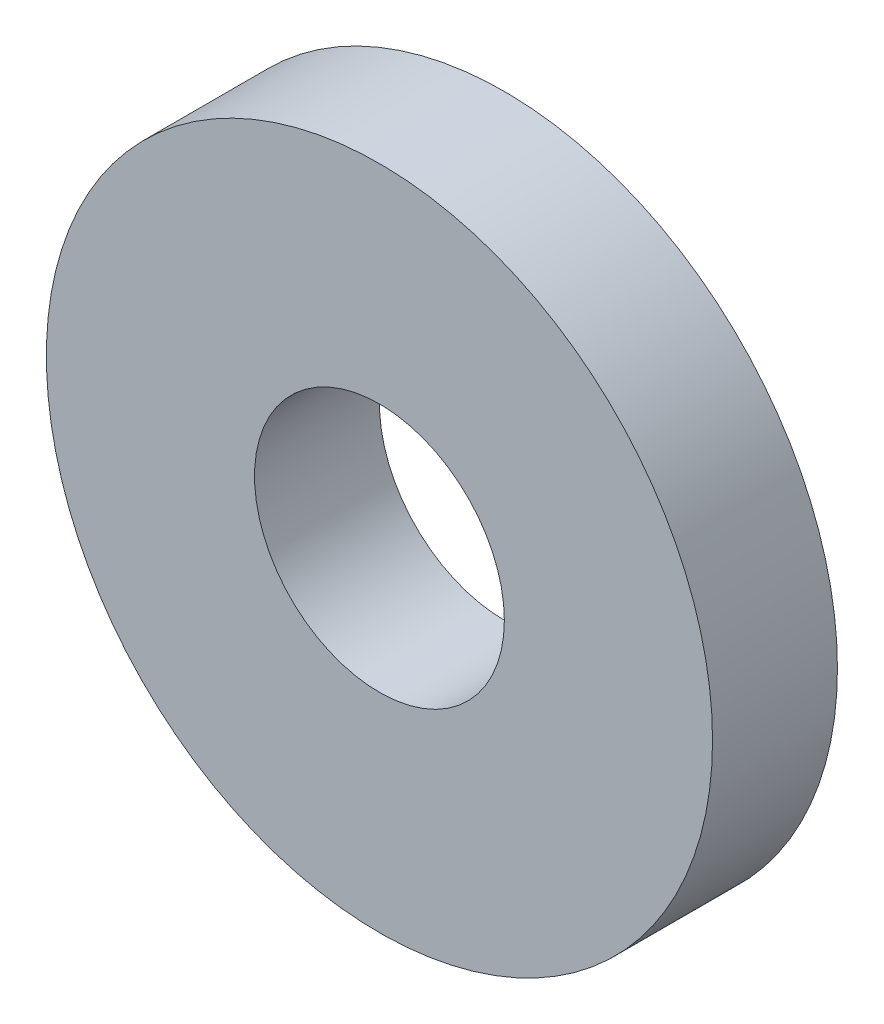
ISO-10303-21;
HEADER;
FILE_DESCRIPTION(('STEP AP214'),'2;1');
FILE_NAME('part.step','',(''),(''),'','','');
FILE_SCHEMA(('AUTOMOTIVE_DESIGN { 1 0 10303 214 1 1 1 1 }'));
ENDSEC;
DATA;
#1=APPLICATION_CONTEXT('core data for automotive mechanical design processes');
#2=APPLICATION_PROTOCOL_DEFINITION('international standard','automotive_design',2000,#1);
#3=PRODUCT_CONTEXT('',#1,'mechanical');
#4=PRODUCT('Part','Part','',(#3));
#5=PRODUCT_RELATED_PRODUCT_CATEGORY('part','',(#4));
#6=PRODUCT_DEFINITION_FORMATION('','',#4);
#7=PRODUCT_DEFINITION_CONTEXT('part definition',#1,'design');
#8=PRODUCT_DEFINITION('design','',#6,#7);
#9=PRODUCT_DEFINITION_SHAPE('','',#8);
#10=(LENGTH_UNIT() NAMED_UNIT(*) SI_UNIT(.MILLI.,.METRE.));
#11=(NAMED_UNIT(*) PLANE_ANGLE_UNIT() SI_UNIT($,.RADIAN.));
#12=(NAMED_UNIT(*) SI_UNIT($,.STERADIAN.) SOLID_ANGLE_UNIT());
#13=UNCERTAINTY_MEASURE_WITH_UNIT(LENGTH_MEASURE(1.E-05),#10,'distance_accuracy_value','');
#14=(GEOMETRIC_REPRESENTATION_CONTEXT(3) GLOBAL_UNCERTAINTY_ASSIGNED_CONTEXT((#13)) GLOBAL_UNIT_ASSIGNED_CONTEXT((#10,
#11,#12)) REPRESENTATION_CONTEXT('',''));
#15=CARTESIAN_POINT('',(0.,0.,0.));
#16=DIRECTION('',(0.,0.,1.));
#17=DIRECTION('',(1.,0.,0.));
#18=AXIS2_PLACEMENT_3D('',#15,#16,#17);
#19=CARTESIAN_POINT('',(-396.363758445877,-302.221968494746,-30.));
#20=DIRECTION('',(0.,0.,1.));
#21=DIRECTION('',(1.,0.,0.));
#22=AXIS2_PLACEMENT_3D('',#19,#20,#21);
#23=CYLINDRICAL_SURFACE('',#22,80.);
#24=CARTESIAN_POINT('',(-396.363758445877,-302.221968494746,-30.));
#25=DIRECTION('',(0.,0.,1.));
#26=DIRECTION('',(1.,0.,0.));
#27=AXIS2_PLACEMENT_3D('',#24,#25,#26);
#28=CIRCLE('',#27,80.);
#29=CARTESIAN_POINT('',(-316.363758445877,-302.221968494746,-30.));
#30=VERTEX_POINT('',#29);
#31=EDGE_CURVE('E10',#30,#30,#28,.T.);
#32=ORIENTED_EDGE('',*,*,#31,.T.);
#33=EDGE_LOOP('',(#32));
#34=FACE_BOUND('',#33,.T.);
#35=CARTESIAN_POINT('',(-396.363758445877,-302.221968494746,0.));
#36=DIRECTION('',(0.,0.,1.));
#37=DIRECTION('',(1.,0.,0.));
#38=AXIS2_PLACEMENT_3D('',#35,#36,#37);
#39=CIRCLE('',#38,80.);
#40=CARTESIAN_POINT('',(-316.363758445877,-302.221968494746,0.));
#41=VERTEX_POINT('',#40);
#42=EDGE_CURVE('E33',#41,#41,#39,.T.);
#43=ORIENTED_EDGE('',*,*,#42,.F.);
#44=EDGE_LOOP('',(#43));
#45=FACE_BOUND('',#44,.T.);
#46=ADVANCED_FACE('F30',(#34,#45),#23,.T.);
#47=CARTESIAN_POINT('',(-396.363758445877,-302.221968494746,-30.));
#48=DIRECTION('',(0.,0.,1.));
#49=DIRECTION('',(1.,0.,0.));
#50=AXIS2_PLACEMENT_3D('',#47,#48,#49);
#51=PLANE('',#50);
#52=CARTESIAN_POINT('',(-396.363758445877,-302.221968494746,-30.));
#53=DIRECTION('',(0.,0.,1.));
#54=DIRECTION('',(1.,0.,0.));
#55=AXIS2_PLACEMENT_3D('',#52,#53,#54);
#56=CIRCLE('',#55,30.0000000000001);
#57=CARTESIAN_POINT('',(-366.363758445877,-302.221968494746,-30.));
#58=VERTEX_POINT('',#57);
#59=EDGE_CURVE('E40',#58,#58,#56,.T.);
#60=ORIENTED_EDGE('',*,*,#59,.T.);
#61=EDGE_LOOP('',(#60));
#62=FACE_BOUND('',#61,.T.);
#63=ORIENTED_EDGE('',*,*,#31,.F.);
#64=EDGE_LOOP('',(#63));
#65=FACE_BOUND('',#64,.T.);
#66=ADVANCED_FACE('F48',(#62,#65),#51,.F.);
#67=CARTESIAN_POINT('',(-396.363758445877,-302.221968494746,0.));
#68=DIRECTION('',(0.,0.,1.));
#69=DIRECTION('',(1.,0.,0.));
#70=AXIS2_PLACEMENT_3D('',#67,#68,#69);
#71=PLANE('',#70);
#72=CARTESIAN_POINT('',(-396.363758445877,-302.221968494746,0.));
#73=DIRECTION('',(0.,0.,1.));
#74=DIRECTION('',(1.,0.,0.));
#75=AXIS2_PLACEMENT_3D('',#72,#73,#74);
#76=CIRCLE('',#75,30.0000000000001);
#77=CARTESIAN_POINT('',(-366.363758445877,-302.221968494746,0.));
#78=VERTEX_POINT('',#77);
#79=EDGE_CURVE('E42',#78,#78,#76,.T.);
#80=ORIENTED_EDGE('',*,*,#79,.F.);
#81=EDGE_LOOP('',(#80));
#82=FACE_BOUND('',#81,.T.);
#83=ORIENTED_EDGE('',*,*,#42,.T.);
#84=EDGE_LOOP('',(#83));
#85=FACE_BOUND('',#84,.T.);
#86=ADVANCED_FACE('F54',(#82,#85),#71,.T.);
#87=CARTESIAN_POINT('',(-396.363758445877,-302.221968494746,-30.));
#88=DIRECTION('',(0.,0.,1.));
#89=DIRECTION('',(1.,0.,0.));
#90=AXIS2_PLACEMENT_3D('',#87,#88,#89);
#91=CYLINDRICAL_SURFACE('',#90,30.0000000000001);
#92=ORIENTED_EDGE('',*,*,#59,.F.);
#93=EDGE_LOOP('',(#92));
#94=FACE_BOUND('',#93,.T.);
#95=ORIENTED_EDGE('',*,*,#79,.T.);
#96=EDGE_LOOP('',(#95));
#97=FACE_BOUND('',#96,.T.);
#98=ADVANCED_FACE('F51',(#94,#97),#91,.F.);
#99=CLOSED_SHELL('',(#46,#66,#86,#98));
#100=MANIFOLD_SOLID_BREP('B2',#99);
#101=ADVANCED_BREP_SHAPE_REPRESENTATION('',(#18,#100),#14);
#102=SHAPE_DEFINITION_REPRESENTATION(#9,#101);
ENDSEC;
END-ISO-10303-21;
